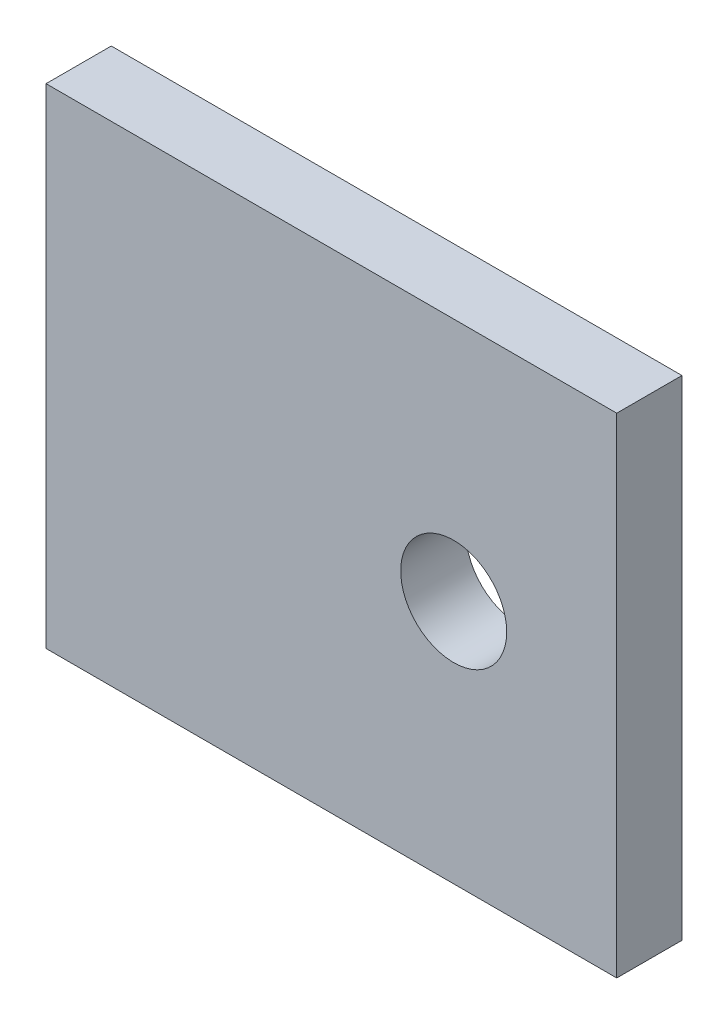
from build123d import *

# Parameters (mm, degrees)
SKETCH_1_W      = 70
SKETCH_1_H      = 60
SKETCH_1_R      = 6.5
EXTRUDE_1_DEPTH = 8


with BuildPart() as part:
    # Sketch 1 → Extrude 1 (new body)
    with BuildSketch(Plane.XY):
        with Locations((35, 30)):
            Rectangle(SKETCH_1_W, SKETCH_1_H)
        with Locations((50, 30)):
            Circle(SKETCH_1_R, mode=Mode.SUBTRACT)
    extrude(amount=EXTRUDE_1_DEPTH)


solid = part.part
